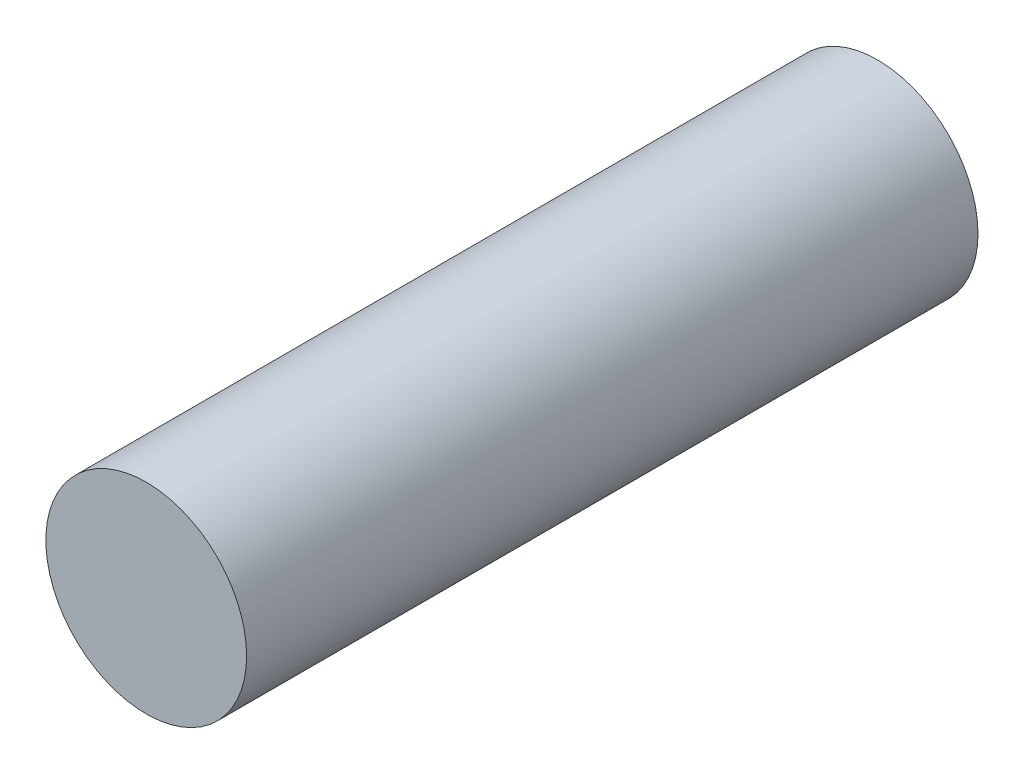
ISO-10303-21;
HEADER;
FILE_DESCRIPTION(('STEP AP214'),'2;1');
FILE_NAME('part.step','',(''),(''),'','','');
FILE_SCHEMA(('AUTOMOTIVE_DESIGN { 1 0 10303 214 1 1 1 1 }'));
ENDSEC;
DATA;
#1=APPLICATION_CONTEXT('core data for automotive mechanical design processes');
#2=APPLICATION_PROTOCOL_DEFINITION('international standard','automotive_design',2000,#1);
#3=PRODUCT_CONTEXT('',#1,'mechanical');
#4=PRODUCT('Part','Part','',(#3));
#5=PRODUCT_RELATED_PRODUCT_CATEGORY('part','',(#4));
#6=PRODUCT_DEFINITION_FORMATION('','',#4);
#7=PRODUCT_DEFINITION_CONTEXT('part definition',#1,'design');
#8=PRODUCT_DEFINITION('design','',#6,#7);
#9=PRODUCT_DEFINITION_SHAPE('','',#8);
#10=(LENGTH_UNIT() NAMED_UNIT(*) SI_UNIT(.MILLI.,.METRE.));
#11=(NAMED_UNIT(*) PLANE_ANGLE_UNIT() SI_UNIT($,.RADIAN.));
#12=(NAMED_UNIT(*) SI_UNIT($,.STERADIAN.) SOLID_ANGLE_UNIT());
#13=UNCERTAINTY_MEASURE_WITH_UNIT(LENGTH_MEASURE(1.E-05),#10,'distance_accuracy_value','');
#14=(GEOMETRIC_REPRESENTATION_CONTEXT(3) GLOBAL_UNCERTAINTY_ASSIGNED_CONTEXT((#13)) GLOBAL_UNIT_ASSIGNED_CONTEXT((#10,
#11,#12)) REPRESENTATION_CONTEXT('',''));
#15=CARTESIAN_POINT('',(0.,0.,0.));
#16=DIRECTION('',(0.,0.,1.));
#17=DIRECTION('',(1.,0.,0.));
#18=AXIS2_PLACEMENT_3D('',#15,#16,#17);
#19=CARTESIAN_POINT('',(0.,0.,51.));
#20=DIRECTION('',(0.,0.,-1.));
#21=DIRECTION('',(-1.,0.,0.));
#22=AXIS2_PLACEMENT_3D('',#19,#20,#21);
#23=CYLINDRICAL_SURFACE('',#22,14.);
#24=CARTESIAN_POINT('',(0.,0.,51.));
#25=DIRECTION('',(0.,0.,1.));
#26=DIRECTION('',(1.,0.,0.));
#27=AXIS2_PLACEMENT_3D('',#24,#25,#26);
#28=CIRCLE('',#27,14.);
#29=CARTESIAN_POINT('',(14.,0.,51.));
#30=VERTEX_POINT('',#29);
#31=EDGE_CURVE('E10',#30,#30,#28,.T.);
#32=ORIENTED_EDGE('',*,*,#31,.F.);
#33=EDGE_LOOP('',(#32));
#34=FACE_BOUND('',#33,.T.);
#35=CARTESIAN_POINT('',(0.,0.,-51.));
#36=DIRECTION('',(0.,0.,1.));
#37=DIRECTION('',(1.,0.,0.));
#38=AXIS2_PLACEMENT_3D('',#35,#36,#37);
#39=CIRCLE('',#38,14.);
#40=CARTESIAN_POINT('',(14.,0.,-51.));
#41=VERTEX_POINT('',#40);
#42=EDGE_CURVE('E42',#41,#41,#39,.T.);
#43=ORIENTED_EDGE('',*,*,#42,.T.);
#44=EDGE_LOOP('',(#43));
#45=FACE_BOUND('',#44,.T.);
#46=ADVANCED_FACE('F39',(#34,#45),#23,.T.);
#47=CARTESIAN_POINT('',(0.,0.,51.));
#48=DIRECTION('',(0.,0.,1.));
#49=DIRECTION('',(1.,0.,0.));
#50=AXIS2_PLACEMENT_3D('',#47,#48,#49);
#51=PLANE('',#50);
#52=ORIENTED_EDGE('',*,*,#31,.T.);
#53=EDGE_LOOP('',(#52));
#54=FACE_BOUND('',#53,.T.);
#55=ADVANCED_FACE('F54',(#54),#51,.T.);
#56=CARTESIAN_POINT('',(0.,0.,-51.));
#57=DIRECTION('',(0.,0.,1.));
#58=DIRECTION('',(1.,0.,0.));
#59=AXIS2_PLACEMENT_3D('',#56,#57,#58);
#60=PLANE('',#59);
#61=ORIENTED_EDGE('',*,*,#42,.F.);
#62=EDGE_LOOP('',(#61));
#63=FACE_BOUND('',#62,.T.);
#64=ADVANCED_FACE('F52',(#63),#60,.F.);
#65=CLOSED_SHELL('',(#46,#55,#64));
#66=MANIFOLD_SOLID_BREP('B2',#65);
#67=ADVANCED_BREP_SHAPE_REPRESENTATION('',(#18,#66),#14);
#68=SHAPE_DEFINITION_REPRESENTATION(#9,#67);
ENDSEC;
END-ISO-10303-21;
